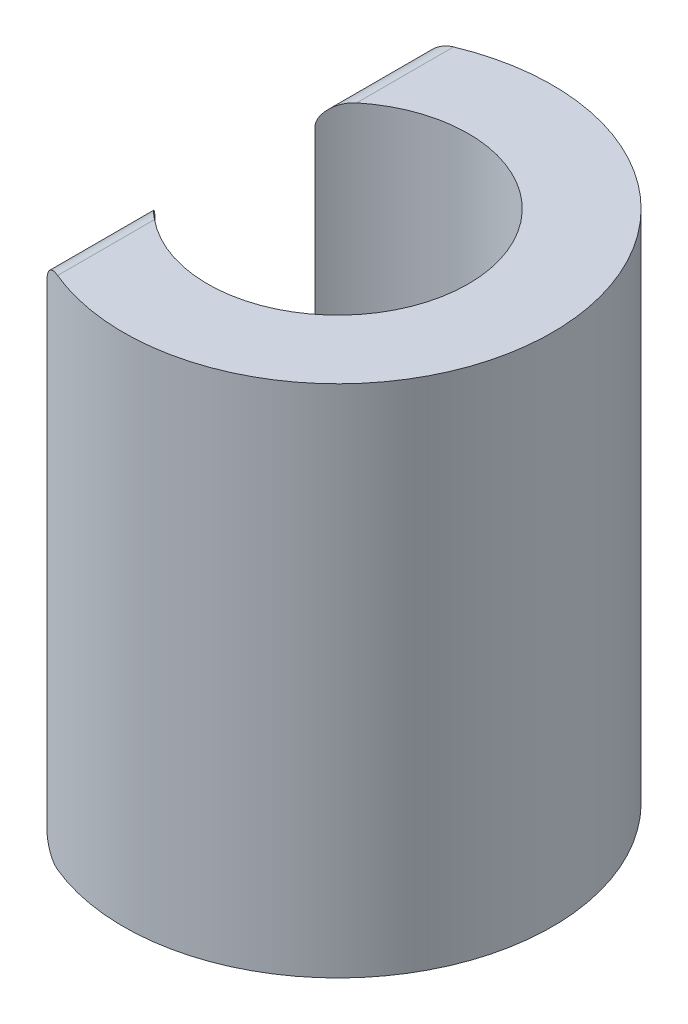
ISO-10303-21;
HEADER;
FILE_DESCRIPTION(('STEP AP214'),'2;1');
FILE_NAME('part.step','',(''),(''),'','','');
FILE_SCHEMA(('AUTOMOTIVE_DESIGN { 1 0 10303 214 1 1 1 1 }'));
ENDSEC;
DATA;
#1=APPLICATION_CONTEXT('core data for automotive mechanical design processes');
#2=APPLICATION_PROTOCOL_DEFINITION('international standard','automotive_design',2000,#1);
#3=PRODUCT_CONTEXT('',#1,'mechanical');
#4=PRODUCT('Part','Part','',(#3));
#5=PRODUCT_RELATED_PRODUCT_CATEGORY('part','',(#4));
#6=PRODUCT_DEFINITION_FORMATION('','',#4);
#7=PRODUCT_DEFINITION_CONTEXT('part definition',#1,'design');
#8=PRODUCT_DEFINITION('design','',#6,#7);
#9=PRODUCT_DEFINITION_SHAPE('','',#8);
#10=(LENGTH_UNIT() NAMED_UNIT(*) SI_UNIT(.MILLI.,.METRE.));
#11=(NAMED_UNIT(*) PLANE_ANGLE_UNIT() SI_UNIT($,.RADIAN.));
#12=(NAMED_UNIT(*) SI_UNIT($,.STERADIAN.) SOLID_ANGLE_UNIT());
#13=UNCERTAINTY_MEASURE_WITH_UNIT(LENGTH_MEASURE(1.E-05),#10,'distance_accuracy_value','');
#14=(GEOMETRIC_REPRESENTATION_CONTEXT(3) GLOBAL_UNCERTAINTY_ASSIGNED_CONTEXT((#13)) GLOBAL_UNIT_ASSIGNED_CONTEXT((#10,
#11,#12)) REPRESENTATION_CONTEXT('',''));
#15=CARTESIAN_POINT('',(0.,0.,0.));
#16=DIRECTION('',(0.,0.,1.));
#17=DIRECTION('',(1.,0.,0.));
#18=AXIS2_PLACEMENT_3D('',#15,#16,#17);
#19=CARTESIAN_POINT('',(0.,19.05,0.));
#20=DIRECTION('',(0.,-1.,0.));
#21=DIRECTION('',(0.,0.,-1.));
#22=AXIS2_PLACEMENT_3D('',#19,#20,#21);
#23=CYLINDRICAL_SURFACE('',#22,7.93750000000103);
#24=DIRECTION('',(0.,-1.,0.));
#25=VECTOR('',#24,1.);
#26=CARTESIAN_POINT('',(-3.81000000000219,19.05,-6.96331862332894));
#27=LINE('',#26,#25);
#28=CARTESIAN_POINT('',(-3.81000000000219,18.288,-6.96331862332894));
#29=VERTEX_POINT('',#28);
#30=CARTESIAN_POINT('',(-3.81000000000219,0.762000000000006,-6.96331862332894));
#31=VERTEX_POINT('',#30);
#32=EDGE_CURVE('E120',#29,#31,#27,.T.);
#33=ORIENTED_EDGE('',*,*,#32,.F.);
#34=CARTESIAN_POINT('',(-3.81000000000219,18.288,-6.96331862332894));
#35=CARTESIAN_POINT('',(-3.81000112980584,18.3076710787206,-6.96331747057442));
#36=CARTESIAN_POINT('',(-3.8092377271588,18.327331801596,-6.96373575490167));
#37=CARTESIAN_POINT('',(-3.80620065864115,18.3664943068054,-6.96539642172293));
#38=CARTESIAN_POINT('',(-3.8039275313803,18.3859961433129,-6.96663851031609));
#39=CARTESIAN_POINT('',(-3.79490229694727,18.443875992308,-6.97156167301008));
#40=CARTESIAN_POINT('',(-3.78594388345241,18.48183544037,-6.97643997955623));
#41=CARTESIAN_POINT('',(-3.76256924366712,18.5554471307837,-6.98907378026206));
#42=CARTESIAN_POINT('',(-3.74815831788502,18.5911015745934,-6.9968264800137));
#43=CARTESIAN_POINT('',(-3.71445934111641,18.6593850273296,-7.01477452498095));
#44=CARTESIAN_POINT('',(-3.69516692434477,18.692011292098,-7.0249720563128));
#45=CARTESIAN_POINT('',(-3.65119240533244,18.7552991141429,-7.04793209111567));
#46=CARTESIAN_POINT('',(-3.62627288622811,18.7857550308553,-7.06080453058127));
#47=CARTESIAN_POINT('',(-3.57250514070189,18.8421273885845,-7.08816079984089));
#48=CARTESIAN_POINT('',(-3.54365555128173,18.8680422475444,-7.10264518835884));
#49=CARTESIAN_POINT('',(-3.47924778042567,18.9176872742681,-7.13443555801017));
#50=CARTESIAN_POINT('',(-3.44329968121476,18.9408267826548,-7.1518746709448));
#51=CARTESIAN_POINT('',(-3.3683379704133,18.9806986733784,-7.18748436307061));
#52=CARTESIAN_POINT('',(-3.32932322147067,18.9974286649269,-7.20565521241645));
#53=CARTESIAN_POINT('',(-3.25046580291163,19.0237447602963,-7.24155920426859));
#54=CARTESIAN_POINT('',(-3.21069330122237,19.0335490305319,-7.25928692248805));
#55=CARTESIAN_POINT('',(-3.13000227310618,19.0466783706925,-7.29444815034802));
#56=CARTESIAN_POINT('',(-3.08908456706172,19.0500079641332,-7.31188185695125));
#57=CARTESIAN_POINT('',(-3.04800000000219,19.05,-7.32895642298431));
#58=B_SPLINE_CURVE_WITH_KNOTS('',3,(#34,#35,#36,#37,#38,#39,#40,#41,#42,#43,#44,#45,#46,#47,#48,
#49,#50,#51,#52,#53,#54,#55,#56,#57),.UNSPECIFIED.,.F.,.F.,(4,2,2,2,2,2,2,2,2,2,2,4),(0.,
0.0589738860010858,0.117926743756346,0.235219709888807,0.352398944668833,0.469683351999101,
0.593394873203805,0.717149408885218,0.855085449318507,0.993072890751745,1.1264921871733,
1.25981823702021),.UNSPECIFIED.);
#59=CARTESIAN_POINT('',(-3.04800000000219,19.05,-7.32895642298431));
#60=VERTEX_POINT('',#59);
#61=EDGE_CURVE('E107',#29,#60,#58,.T.);
#62=ORIENTED_EDGE('',*,*,#61,.T.);
#63=CARTESIAN_POINT('',(0.,19.05,0.));
#64=DIRECTION('',(0.,1.,0.));
#65=DIRECTION('',(0.,0.,1.));
#66=AXIS2_PLACEMENT_3D('',#63,#64,#65);
#67=CIRCLE('',#66,7.93750000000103);
#68=CARTESIAN_POINT('',(-3.04800000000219,19.05,7.32895642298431));
#69=VERTEX_POINT('',#68);
#70=EDGE_CURVE('E115',#69,#60,#67,.T.);
#71=ORIENTED_EDGE('',*,*,#70,.F.);
#72=CARTESIAN_POINT('',(-3.04800000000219,19.05,7.32895642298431));
#73=CARTESIAN_POINT('',(-3.09471095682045,19.0500130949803,7.30954976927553));
#74=CARTESIAN_POINT('',(-3.14120250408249,19.0457067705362,7.28967184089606));
#75=CARTESIAN_POINT('',(-3.23255304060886,19.0287684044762,7.2496151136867));
#76=CARTESIAN_POINT('',(-3.27741083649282,19.0161304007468,7.22943610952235));
#77=CARTESIAN_POINT('',(-3.36424114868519,18.9828382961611,7.18944331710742));
#78=CARTESIAN_POINT('',(-3.4062129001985,18.96218208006,7.16962962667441));
#79=CARTESIAN_POINT('',(-3.48605356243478,18.9132546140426,7.13114965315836));
#80=CARTESIAN_POINT('',(-3.52392335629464,18.8849850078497,7.11248312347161));
#81=CARTESIAN_POINT('',(-3.59357767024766,18.8219935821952,7.07754170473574));
#82=CARTESIAN_POINT('',(-3.62547039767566,18.7874148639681,7.06122585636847));
#83=CARTESIAN_POINT('',(-3.68280061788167,18.7121515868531,7.03149566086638));
#84=CARTESIAN_POINT('',(-3.70824083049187,18.6714696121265,7.01808009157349));
#85=CARTESIAN_POINT('',(-3.74921448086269,18.5893932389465,6.99626935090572));
#86=CARTESIAN_POINT('',(-3.76547349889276,18.5484576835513,6.9875114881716));
#87=CARTESIAN_POINT('',(-3.79073759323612,18.4638445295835,6.97383869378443));
#88=CARTESIAN_POINT('',(-3.7997615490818,18.4201743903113,6.96891376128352));
#89=CARTESIAN_POINT('',(-3.8066005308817,18.3613988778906,6.96517769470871));
#90=CARTESIAN_POINT('',(-3.80787501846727,18.3467473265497,6.96448093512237));
#91=CARTESIAN_POINT('',(-3.80957365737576,18.3173998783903,6.96355197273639));
#92=CARTESIAN_POINT('',(-3.80999893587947,18.3027040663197,6.96331915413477));
#93=CARTESIAN_POINT('',(-3.8100000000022,18.288,6.96331862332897));
#94=B_SPLINE_CURVE_WITH_KNOTS('',3,(#72,#73,#74,#75,#76,#77,#78,#79,#80,#81,#82,#83,#84,#85,#86,
#87,#88,#89,#90,#91,#92,#93),.UNSPECIFIED.,.F.,.F.,(4,2,2,2,2,2,2,2,2,2,4),(0.,0.15153372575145,
0.303176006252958,0.454858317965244,0.606507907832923,0.755069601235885,0.903568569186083,
1.03754345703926,1.17116759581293,1.21531404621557,1.25940186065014),.UNSPECIFIED.);
#95=CARTESIAN_POINT('',(-3.81000000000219,18.288,6.96331862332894));
#96=VERTEX_POINT('',#95);
#97=EDGE_CURVE('E59',#69,#96,#94,.T.);
#98=ORIENTED_EDGE('',*,*,#97,.T.);
#99=DIRECTION('',(0.,-1.,0.));
#100=VECTOR('',#99,1.);
#101=CARTESIAN_POINT('',(-3.81000000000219,19.05,6.96331862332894));
#102=LINE('',#101,#100);
#103=CARTESIAN_POINT('',(-3.81000000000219,0.762000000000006,6.96331862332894));
#104=VERTEX_POINT('',#103);
#105=EDGE_CURVE('E126',#96,#104,#102,.T.);
#106=ORIENTED_EDGE('',*,*,#105,.T.);
#107=CARTESIAN_POINT('',(-3.81000000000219,0.761999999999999,6.96331862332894));
#108=CARTESIAN_POINT('',(-3.81000112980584,0.742328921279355,6.96331747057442));
#109=CARTESIAN_POINT('',(-3.8092377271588,0.722668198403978,6.96373575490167));
#110=CARTESIAN_POINT('',(-3.80620065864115,0.683505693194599,6.96539642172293));
#111=CARTESIAN_POINT('',(-3.8039275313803,0.664003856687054,6.96663851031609));
#112=CARTESIAN_POINT('',(-3.79490229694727,0.606124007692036,6.97156167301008));
#113=CARTESIAN_POINT('',(-3.78594388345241,0.568164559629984,6.97643997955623));
#114=CARTESIAN_POINT('',(-3.76256924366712,0.494552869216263,6.98907378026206));
#115=CARTESIAN_POINT('',(-3.74815831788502,0.4588984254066,6.99682648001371));
#116=CARTESIAN_POINT('',(-3.7144593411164,0.390614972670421,7.01477452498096));
#117=CARTESIAN_POINT('',(-3.69516692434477,0.357988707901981,7.0249720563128));
#118=CARTESIAN_POINT('',(-3.65119240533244,0.294700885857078,7.04793209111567));
#119=CARTESIAN_POINT('',(-3.62627288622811,0.264244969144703,7.06080453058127));
#120=CARTESIAN_POINT('',(-3.57250514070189,0.207872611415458,7.08816079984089));
#121=CARTESIAN_POINT('',(-3.54365555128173,0.181957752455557,7.10264518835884));
#122=CARTESIAN_POINT('',(-3.47924778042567,0.132312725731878,7.13443555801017));
#123=CARTESIAN_POINT('',(-3.44329968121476,0.109173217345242,7.1518746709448));
#124=CARTESIAN_POINT('',(-3.3683379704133,0.0693013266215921,7.18748436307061));
#125=CARTESIAN_POINT('',(-3.32932322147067,0.0525713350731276,7.20565521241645));
#126=CARTESIAN_POINT('',(-3.25046580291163,0.0262552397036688,7.24155920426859));
#127=CARTESIAN_POINT('',(-3.21069330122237,0.0164509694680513,7.25928692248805));
#128=CARTESIAN_POINT('',(-3.13000227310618,0.00332162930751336,7.29444815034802));
#129=CARTESIAN_POINT('',(-3.08908456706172,-7.9641331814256E-06,7.31188185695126));
#130=CARTESIAN_POINT('',(-3.04800000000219,0.,7.32895642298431));
#131=B_SPLINE_CURVE_WITH_KNOTS('',3,(#107,#108,#109,#110,#111,#112,#113,#114,#115,#116,#117,
#118,#119,#120,#121,#122,#123,#124,#125,#126,#127,#128,#129,#130),.UNSPECIFIED.,.F.,.F.,(4,2,2,
2,2,2,2,2,2,2,2,4),(0.,0.0589738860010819,0.117926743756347,0.235219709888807,0.352398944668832,
0.469683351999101,0.593394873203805,0.717149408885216,0.855085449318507,0.993072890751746,
1.1264921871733,1.25981823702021),.UNSPECIFIED.);
#132=CARTESIAN_POINT('',(-3.04800000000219,0.,7.32895642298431));
#133=VERTEX_POINT('',#132);
#134=EDGE_CURVE('E51',#104,#133,#131,.T.);
#135=ORIENTED_EDGE('',*,*,#134,.T.);
#136=CARTESIAN_POINT('',(0.,0.,0.));
#137=DIRECTION('',(0.,1.,0.));
#138=DIRECTION('',(0.,0.,1.));
#139=AXIS2_PLACEMENT_3D('',#136,#137,#138);
#140=CIRCLE('',#139,7.93750000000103);
#141=CARTESIAN_POINT('',(-3.04800000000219,0.,-7.32895642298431));
#142=VERTEX_POINT('',#141);
#143=EDGE_CURVE('E129',#133,#142,#140,.T.);
#144=ORIENTED_EDGE('',*,*,#143,.T.);
#145=CARTESIAN_POINT('',(-3.04800000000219,0.,-7.32895642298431));
#146=CARTESIAN_POINT('',(-3.09471095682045,-1.30949802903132E-05,-7.30954976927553));
#147=CARTESIAN_POINT('',(-3.14120250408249,0.00429322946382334,-7.28967184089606));
#148=CARTESIAN_POINT('',(-3.23255304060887,0.0212315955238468,-7.2496151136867));
#149=CARTESIAN_POINT('',(-3.27741083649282,0.0338695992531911,-7.22943610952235));
#150=CARTESIAN_POINT('',(-3.36424114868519,0.067161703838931,-7.18944331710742));
#151=CARTESIAN_POINT('',(-3.4062129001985,0.0878179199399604,-7.16962962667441));
#152=CARTESIAN_POINT('',(-3.48605356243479,0.136745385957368,-7.13114965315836));
#153=CARTESIAN_POINT('',(-3.52392335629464,0.16501499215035,-7.11248312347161));
#154=CARTESIAN_POINT('',(-3.59357767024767,0.22800641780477,-7.07754170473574));
#155=CARTESIAN_POINT('',(-3.62547039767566,0.262585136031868,-7.06122585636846));
#156=CARTESIAN_POINT('',(-3.68280061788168,0.337848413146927,-7.03149566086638));
#157=CARTESIAN_POINT('',(-3.70824083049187,0.378530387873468,-7.01808009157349));
#158=CARTESIAN_POINT('',(-3.74921448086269,0.460606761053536,-6.99626935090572));
#159=CARTESIAN_POINT('',(-3.76547349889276,0.501542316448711,-6.9875114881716));
#160=CARTESIAN_POINT('',(-3.79073759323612,0.586155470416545,-6.97383869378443));
#161=CARTESIAN_POINT('',(-3.7997615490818,0.629825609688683,-6.96891376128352));
#162=CARTESIAN_POINT('',(-3.8066005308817,0.688601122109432,-6.96517769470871));
#163=CARTESIAN_POINT('',(-3.80787501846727,0.703252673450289,-6.96448093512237));
#164=CARTESIAN_POINT('',(-3.80957365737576,0.732600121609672,-6.96355197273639));
#165=CARTESIAN_POINT('',(-3.80999893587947,0.747295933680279,-6.96331915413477));
#166=CARTESIAN_POINT('',(-3.8100000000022,0.762,-6.96331862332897));
#167=B_SPLINE_CURVE_WITH_KNOTS('',3,(#145,#146,#147,#148,#149,#150,#151,#152,#153,#154,#155,
#156,#157,#158,#159,#160,#161,#162,#163,#164,#165,#166),.UNSPECIFIED.,.F.,.F.,(4,2,2,2,2,2,2,2,
2,2,4),(0.,0.151533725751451,0.303176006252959,0.454858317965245,0.606507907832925,
0.755069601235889,0.903568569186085,1.03754345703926,1.17116759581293,1.21531404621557,
1.25940186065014),.UNSPECIFIED.);
#168=EDGE_CURVE('E108',#142,#31,#167,.T.);
#169=ORIENTED_EDGE('',*,*,#168,.T.);
#170=EDGE_LOOP('',(#33,#62,#71,#98,#106,#135,#144,#169));
#171=FACE_BOUND('',#170,.T.);
#172=ADVANCED_FACE('F35',(#171),#23,.T.);
#173=CARTESIAN_POINT('',(-3.81000000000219,19.05,-6.96331862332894));
#174=DIRECTION('',(1.,0.,0.));
#175=DIRECTION('',(0.,0.,-1.));
#176=AXIS2_PLACEMENT_3D('',#173,#174,#175);
#177=PLANE('',#176);
#178=DIRECTION('',(0.,-1.,0.));
#179=VECTOR('',#178,1.);
#180=CARTESIAN_POINT('',(-3.81000000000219,19.05,-2.96212356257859));
#181=LINE('',#180,#179);
#182=CARTESIAN_POINT('',(-3.81000000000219,18.288,-2.96212356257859));
#183=VERTEX_POINT('',#182);
#184=CARTESIAN_POINT('',(-3.81000000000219,0.762000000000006,-2.96212356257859));
#185=VERTEX_POINT('',#184);
#186=EDGE_CURVE('E138',#183,#185,#181,.T.);
#187=ORIENTED_EDGE('',*,*,#186,.F.);
#188=DIRECTION('',(0.,0.,1.));
#189=VECTOR('',#188,1.);
#190=CARTESIAN_POINT('',(-3.81000000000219,18.288,-6.96331862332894));
#191=LINE('',#190,#189);
#192=EDGE_CURVE('E209',#183,#29,#191,.F.);
#193=ORIENTED_EDGE('',*,*,#192,.T.);
#194=ORIENTED_EDGE('',*,*,#32,.T.);
#195=DIRECTION('',(0.,0.,1.));
#196=VECTOR('',#195,1.);
#197=CARTESIAN_POINT('',(-3.81000000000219,0.761999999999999,-6.96331862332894));
#198=LINE('',#197,#196);
#199=EDGE_CURVE('E210',#31,#185,#198,.T.);
#200=ORIENTED_EDGE('',*,*,#199,.T.);
#201=EDGE_LOOP('',(#187,#193,#194,#200));
#202=FACE_BOUND('',#201,.T.);
#203=ADVANCED_FACE('F161',(#202),#177,.F.);
#204=CARTESIAN_POINT('',(0.,19.05,0.));
#205=DIRECTION('',(0.,-1.,0.));
#206=DIRECTION('',(0.,0.,-1.));
#207=AXIS2_PLACEMENT_3D('',#204,#205,#206);
#208=CYLINDRICAL_SURFACE('',#207,4.826);
#209=CARTESIAN_POINT('',(0.,19.05,0.));
#210=DIRECTION('',(0.,-1.,0.));
#211=DIRECTION('',(0.,0.,1.));
#212=AXIS2_PLACEMENT_3D('',#209,#210,#211);
#213=CIRCLE('',#212,4.826);
#214=CARTESIAN_POINT('',(-3.04800000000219,19.05,-3.7416536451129));
#215=VERTEX_POINT('',#214);
#216=CARTESIAN_POINT('',(-3.04800000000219,19.05,3.7416536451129));
#217=VERTEX_POINT('',#216);
#218=EDGE_CURVE('E118',#215,#217,#213,.T.);
#219=ORIENTED_EDGE('',*,*,#218,.F.);
#220=CARTESIAN_POINT('',(-3.04800000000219,19.05,-3.7416536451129));
#221=CARTESIAN_POINT('',(-3.07294029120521,19.0499962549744,-3.72133874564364));
#222=CARTESIAN_POINT('',(-3.09766180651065,19.0487758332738,-3.70078336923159));
#223=CARTESIAN_POINT('',(-3.14655009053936,19.0440001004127,-3.65930642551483));
#224=CARTESIAN_POINT('',(-3.17071708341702,19.0404457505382,-3.63838501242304));
#225=CARTESIAN_POINT('',(-3.24245342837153,19.0263862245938,-3.57503086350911));
#226=CARTESIAN_POINT('',(-3.28903431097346,19.0124862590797,-3.53219085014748));
#227=CARTESIAN_POINT('',(-3.38503191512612,18.9736426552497,-3.44047157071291));
#228=CARTESIAN_POINT('',(-3.43392643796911,18.9474209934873,-3.39159011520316));
#229=CARTESIAN_POINT('',(-3.52607090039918,18.8840010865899,-3.29567697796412));
#230=CARTESIAN_POINT('',(-3.56933192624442,18.8468248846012,-3.24864179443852));
#231=CARTESIAN_POINT('',(-3.63248790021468,18.7781290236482,-3.17751221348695));
#232=CARTESIAN_POINT('',(-3.65475421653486,18.7504079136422,-3.15183655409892));
#233=CARTESIAN_POINT('',(-3.69607558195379,18.6904494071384,-3.10327378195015));
#234=CARTESIAN_POINT('',(-3.71513468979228,18.6582178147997,-3.0803831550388));
#235=CARTESIAN_POINT('',(-3.74498164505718,18.5973773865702,-3.04397860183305));
#236=CARTESIAN_POINT('',(-3.75665590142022,18.5697674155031,-3.02953438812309));
#237=CARTESIAN_POINT('',(-3.7769715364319,18.5120026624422,-3.00416776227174));
#238=CARTESIAN_POINT('',(-3.78562391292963,18.4818576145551,-2.99323259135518));
#239=CARTESIAN_POINT('',(-3.7981039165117,18.424706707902,-2.97737684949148));
#240=CARTESIAN_POINT('',(-3.80249770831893,18.3980235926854,-2.97175469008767));
#241=CARTESIAN_POINT('',(-3.80847678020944,18.3435923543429,-2.96408316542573));
#242=CARTESIAN_POINT('',(-3.810035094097,18.3158365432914,-2.96206810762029));
#243=CARTESIAN_POINT('',(-3.81000000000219,18.288,-2.96212356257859));
#244=B_SPLINE_CURVE_WITH_KNOTS('',3,(#220,#221,#222,#223,#224,#225,#226,#227,#228,#229,#230,
#231,#232,#233,#234,#235,#236,#237,#238,#239,#240,#241,#242,#243),.UNSPECIFIED.,.F.,.F.,(4,2,2,
2,2,2,2,2,2,2,2,4),(0.,0.096445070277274,0.192850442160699,0.386519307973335,0.607419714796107,
0.827878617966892,0.959127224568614,1.09020846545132,1.18970016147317,1.28882589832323,
1.3713082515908,1.4545710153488),.UNSPECIFIED.);
#245=EDGE_CURVE('E174',#215,#183,#244,.T.);
#246=ORIENTED_EDGE('',*,*,#245,.T.);
#247=ORIENTED_EDGE('',*,*,#186,.T.);
#248=CARTESIAN_POINT('',(-3.81000000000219,0.761999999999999,-2.96212356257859));
#249=CARTESIAN_POINT('',(-3.81000328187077,0.745759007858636,-2.96211810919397));
#250=CARTESIAN_POINT('',(-3.80948033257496,0.729530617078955,-2.96279205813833));
#251=CARTESIAN_POINT('',(-3.80741682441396,0.697269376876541,-2.96544391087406));
#252=CARTESIAN_POINT('',(-3.80587776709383,0.681236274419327,-2.96741989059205));
#253=CARTESIAN_POINT('',(-3.79984138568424,0.634044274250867,-2.97515122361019));
#254=CARTESIAN_POINT('',(-3.79392273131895,0.603343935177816,-2.98271320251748));
#255=CARTESIAN_POINT('',(-3.77887295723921,0.544291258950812,-3.00175582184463));
#256=CARTESIAN_POINT('',(-3.76975950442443,0.515927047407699,-3.01321490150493));
#257=CARTESIAN_POINT('',(-3.74888180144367,0.461567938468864,-3.03915132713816));
#258=CARTESIAN_POINT('',(-3.73710805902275,0.435582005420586,-3.05363946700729));
#259=CARTESIAN_POINT('',(-3.70372348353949,0.371280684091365,-3.09414617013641));
#260=CARTESIAN_POINT('',(-3.68044633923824,0.334911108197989,-3.12187081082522));
#261=CARTESIAN_POINT('',(-3.62982217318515,0.268150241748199,-3.18059524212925));
#262=CARTESIAN_POINT('',(-3.6024650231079,0.237774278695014,-3.2116031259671));
#263=CARTESIAN_POINT('',(-3.53264880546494,0.171287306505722,-3.28851645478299));
#264=CARTESIAN_POINT('',(-3.48858729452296,0.137906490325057,-3.33533098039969));
#265=CARTESIAN_POINT('',(-3.39543635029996,0.0816416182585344,-3.43011966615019));
#266=CARTESIAN_POINT('',(-3.34634785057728,0.0587556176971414,-3.47809360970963));
#267=CARTESIAN_POINT('',(-3.2560176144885,0.0277715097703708,-3.56251314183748));
#268=CARTESIAN_POINT('',(-3.2156045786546,0.0174724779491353,-3.59904611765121));
#269=CARTESIAN_POINT('',(-3.13301494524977,0.00361054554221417,-3.67117629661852));
#270=CARTESIAN_POINT('',(-3.09084273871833,3.17915344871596E-05,-3.70677550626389));
#271=CARTESIAN_POINT('',(-3.04800000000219,0.,-3.7416536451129));
#272=B_SPLINE_CURVE_WITH_KNOTS('',3,(#248,#249,#250,#251,#252,#253,#254,#255,#256,#257,#258,
#259,#260,#261,#262,#263,#264,#265,#266,#267,#268,#269,#270,#271),.UNSPECIFIED.,.F.,.F.,(4,2,2,
2,2,2,2,2,2,2,2,4),(0.,0.0486775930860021,0.0972834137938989,0.193173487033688,
0.288541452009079,0.384255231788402,0.537339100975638,0.690809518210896,0.907005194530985,
1.12316079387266,1.28906695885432,1.4545812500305),.UNSPECIFIED.);
#273=CARTESIAN_POINT('',(-3.04800000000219,0.,-3.7416536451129));
#274=VERTEX_POINT('',#273);
#275=EDGE_CURVE('E150',#185,#274,#272,.T.);
#276=ORIENTED_EDGE('',*,*,#275,.T.);
#277=CARTESIAN_POINT('',(0.,0.,0.));
#278=DIRECTION('',(0.,-1.,0.));
#279=DIRECTION('',(0.,0.,1.));
#280=AXIS2_PLACEMENT_3D('',#277,#278,#279);
#281=CIRCLE('',#280,4.826);
#282=CARTESIAN_POINT('',(-3.04800000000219,0.,3.7416536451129));
#283=VERTEX_POINT('',#282);
#284=EDGE_CURVE('E124',#274,#283,#281,.T.);
#285=ORIENTED_EDGE('',*,*,#284,.T.);
#286=CARTESIAN_POINT('',(-3.04800000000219,0.,3.7416536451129));
#287=CARTESIAN_POINT('',(-3.07294029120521,3.74502556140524E-06,3.72133874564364));
#288=CARTESIAN_POINT('',(-3.09766180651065,0.00122416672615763,3.70078336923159));
#289=CARTESIAN_POINT('',(-3.14655009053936,0.00599989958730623,3.65930642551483));
#290=CARTESIAN_POINT('',(-3.17071708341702,0.00955424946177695,3.63838501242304));
#291=CARTESIAN_POINT('',(-3.24245342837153,0.023613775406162,3.57503086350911));
#292=CARTESIAN_POINT('',(-3.28903431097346,0.0375137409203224,3.53219085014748));
#293=CARTESIAN_POINT('',(-3.38503191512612,0.0763573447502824,3.44047157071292));
#294=CARTESIAN_POINT('',(-3.43392643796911,0.102579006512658,3.39159011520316));
#295=CARTESIAN_POINT('',(-3.52607090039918,0.165998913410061,3.29567697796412));
#296=CARTESIAN_POINT('',(-3.56933192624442,0.203175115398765,3.24864179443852));
#297=CARTESIAN_POINT('',(-3.63248790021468,0.271870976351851,3.17751221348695));
#298=CARTESIAN_POINT('',(-3.65475421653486,0.299592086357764,3.15183655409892));
#299=CARTESIAN_POINT('',(-3.69607558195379,0.359550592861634,3.10327378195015));
#300=CARTESIAN_POINT('',(-3.71513468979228,0.391782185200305,3.0803831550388));
#301=CARTESIAN_POINT('',(-3.74498164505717,0.452622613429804,3.04397860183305));
#302=CARTESIAN_POINT('',(-3.75665590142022,0.480232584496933,3.02953438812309));
#303=CARTESIAN_POINT('',(-3.7769715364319,0.537997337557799,3.00416776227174));
#304=CARTESIAN_POINT('',(-3.78562391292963,0.56814238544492,2.99323259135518));
#305=CARTESIAN_POINT('',(-3.7981039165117,0.625293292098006,2.97737684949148));
#306=CARTESIAN_POINT('',(-3.80249770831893,0.651976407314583,2.97175469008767));
#307=CARTESIAN_POINT('',(-3.80847678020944,0.706407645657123,2.96408316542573));
#308=CARTESIAN_POINT('',(-3.810035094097,0.734163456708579,2.96206810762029));
#309=CARTESIAN_POINT('',(-3.81000000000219,0.761999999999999,2.96212356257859));
#310=B_SPLINE_CURVE_WITH_KNOTS('',3,(#286,#287,#288,#289,#290,#291,#292,#293,#294,#295,#296,
#297,#298,#299,#300,#301,#302,#303,#304,#305,#306,#307,#308,#309),.UNSPECIFIED.,.F.,.F.,(4,2,2,
2,2,2,2,2,2,2,2,4),(0.,0.0964450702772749,0.1928504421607,0.386519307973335,0.607419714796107,
0.827878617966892,0.959127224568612,1.09020846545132,1.18970016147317,1.28882589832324,
1.3713082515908,1.4545710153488),.UNSPECIFIED.);
#311=CARTESIAN_POINT('',(-3.81000000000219,0.762000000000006,2.96212356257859));
#312=VERTEX_POINT('',#311);
#313=EDGE_CURVE('E144',#283,#312,#310,.T.);
#314=ORIENTED_EDGE('',*,*,#313,.T.);
#315=DIRECTION('',(0.,-1.,0.));
#316=VECTOR('',#315,1.);
#317=CARTESIAN_POINT('',(-3.81000000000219,19.05,2.96212356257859));
#318=LINE('',#317,#316);
#319=CARTESIAN_POINT('',(-3.81000000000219,18.288,2.96212356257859));
#320=VERTEX_POINT('',#319);
#321=EDGE_CURVE('E135',#320,#312,#318,.T.);
#322=ORIENTED_EDGE('',*,*,#321,.F.);
#323=CARTESIAN_POINT('',(-3.81000000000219,18.288,2.96212356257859));
#324=CARTESIAN_POINT('',(-3.81000328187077,18.3042409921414,2.96211810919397));
#325=CARTESIAN_POINT('',(-3.80948033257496,18.320469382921,2.96279205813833));
#326=CARTESIAN_POINT('',(-3.80741682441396,18.3527306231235,2.96544391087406));
#327=CARTESIAN_POINT('',(-3.80587776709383,18.3687637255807,2.96741989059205));
#328=CARTESIAN_POINT('',(-3.79984138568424,18.4159557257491,2.97515122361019));
#329=CARTESIAN_POINT('',(-3.79392273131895,18.4466560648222,2.98271320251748));
#330=CARTESIAN_POINT('',(-3.77887295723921,18.5057087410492,3.00175582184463));
#331=CARTESIAN_POINT('',(-3.76975950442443,18.5340729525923,3.01321490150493));
#332=CARTESIAN_POINT('',(-3.74888180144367,18.5884320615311,3.03915132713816));
#333=CARTESIAN_POINT('',(-3.73710805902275,18.6144179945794,3.05363946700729));
#334=CARTESIAN_POINT('',(-3.70372348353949,18.6787193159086,3.09414617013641));
#335=CARTESIAN_POINT('',(-3.68044633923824,18.715088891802,3.12187081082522));
#336=CARTESIAN_POINT('',(-3.62982217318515,18.7818497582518,3.18059524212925));
#337=CARTESIAN_POINT('',(-3.6024650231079,18.812225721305,3.2116031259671));
#338=CARTESIAN_POINT('',(-3.53264880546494,18.8787126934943,3.28851645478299));
#339=CARTESIAN_POINT('',(-3.48858729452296,18.9120935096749,3.33533098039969));
#340=CARTESIAN_POINT('',(-3.39543635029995,18.9683583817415,3.43011966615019));
#341=CARTESIAN_POINT('',(-3.34634785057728,18.9912443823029,3.47809360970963));
#342=CARTESIAN_POINT('',(-3.2560176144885,19.0222284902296,3.56251314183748));
#343=CARTESIAN_POINT('',(-3.2156045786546,19.0325275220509,3.59904611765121));
#344=CARTESIAN_POINT('',(-3.13301494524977,19.0463894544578,3.67117629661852));
#345=CARTESIAN_POINT('',(-3.09084273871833,19.0499682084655,3.70677550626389));
#346=CARTESIAN_POINT('',(-3.04800000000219,19.05,3.7416536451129));
#347=B_SPLINE_CURVE_WITH_KNOTS('',3,(#323,#324,#325,#326,#327,#328,#329,#330,#331,#332,#333,
#334,#335,#336,#337,#338,#339,#340,#341,#342,#343,#344,#345,#346),.UNSPECIFIED.,.F.,.F.,(4,2,2,
2,2,2,2,2,2,2,2,4),(0.,0.0486775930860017,0.0972834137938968,0.19317348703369,0.288541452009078,
0.384255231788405,0.53733910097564,0.690809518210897,0.907005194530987,1.12316079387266,
1.28906695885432,1.4545812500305),.UNSPECIFIED.);
#348=EDGE_CURVE('E169',#320,#217,#347,.T.);
#349=ORIENTED_EDGE('',*,*,#348,.T.);
#350=EDGE_LOOP('',(#219,#246,#247,#276,#285,#314,#322,#349));
#351=FACE_BOUND('',#350,.T.);
#352=ADVANCED_FACE('F155',(#351),#208,.F.);
#353=CARTESIAN_POINT('',(-3.81000000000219,19.05,2.96212356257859));
#354=DIRECTION('',(1.,0.,0.));
#355=DIRECTION('',(0.,0.,-1.));
#356=AXIS2_PLACEMENT_3D('',#353,#354,#355);
#357=PLANE('',#356);
#358=ORIENTED_EDGE('',*,*,#105,.F.);
#359=DIRECTION('',(0.,0.,1.));
#360=VECTOR('',#359,1.);
#361=CARTESIAN_POINT('',(-3.81000000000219,18.288,2.96212356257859));
#362=LINE('',#361,#360);
#363=EDGE_CURVE('E106',#96,#320,#362,.F.);
#364=ORIENTED_EDGE('',*,*,#363,.T.);
#365=ORIENTED_EDGE('',*,*,#321,.T.);
#366=DIRECTION('',(0.,0.,1.));
#367=VECTOR('',#366,1.);
#368=CARTESIAN_POINT('',(-3.81000000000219,0.761999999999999,2.96212356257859));
#369=LINE('',#368,#367);
#370=EDGE_CURVE('E217',#312,#104,#369,.T.);
#371=ORIENTED_EDGE('',*,*,#370,.T.);
#372=EDGE_LOOP('',(#358,#364,#365,#371));
#373=FACE_BOUND('',#372,.T.);
#374=ADVANCED_FACE('F160',(#373),#357,.F.);
#375=CARTESIAN_POINT('',(0.,19.05,0.));
#376=DIRECTION('',(0.,1.,0.));
#377=DIRECTION('',(0.,0.,1.));
#378=AXIS2_PLACEMENT_3D('',#375,#376,#377);
#379=PLANE('',#378);
#380=ORIENTED_EDGE('',*,*,#70,.T.);
#381=DIRECTION('',(0.,0.,1.));
#382=VECTOR('',#381,1.);
#383=CARTESIAN_POINT('',(-3.04800000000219,19.05,-2.96212356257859));
#384=LINE('',#383,#382);
#385=EDGE_CURVE('E119',#60,#215,#384,.T.);
#386=ORIENTED_EDGE('',*,*,#385,.T.);
#387=ORIENTED_EDGE('',*,*,#218,.T.);
#388=DIRECTION('',(0.,0.,1.));
#389=VECTOR('',#388,1.);
#390=CARTESIAN_POINT('',(-3.04800000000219,19.05,6.96331862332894));
#391=LINE('',#390,#389);
#392=EDGE_CURVE('E105',#217,#69,#391,.T.);
#393=ORIENTED_EDGE('',*,*,#392,.T.);
#394=EDGE_LOOP('',(#380,#386,#387,#393));
#395=FACE_BOUND('',#394,.T.);
#396=ADVANCED_FACE('F113',(#395),#379,.T.);
#397=CARTESIAN_POINT('',(0.,0.,0.));
#398=DIRECTION('',(0.,1.,0.));
#399=DIRECTION('',(0.,0.,1.));
#400=AXIS2_PLACEMENT_3D('',#397,#398,#399);
#401=PLANE('',#400);
#402=ORIENTED_EDGE('',*,*,#284,.F.);
#403=DIRECTION('',(0.,0.,1.));
#404=VECTOR('',#403,1.);
#405=CARTESIAN_POINT('',(-3.04800000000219,0.,0.));
#406=LINE('',#405,#404);
#407=EDGE_CURVE('E11',#274,#142,#406,.F.);
#408=ORIENTED_EDGE('',*,*,#407,.T.);
#409=ORIENTED_EDGE('',*,*,#143,.F.);
#410=DIRECTION('',(0.,0.,1.));
#411=VECTOR('',#410,1.);
#412=CARTESIAN_POINT('',(-3.04800000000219,0.,0.));
#413=LINE('',#412,#411);
#414=EDGE_CURVE('E44',#133,#283,#413,.F.);
#415=ORIENTED_EDGE('',*,*,#414,.T.);
#416=EDGE_LOOP('',(#402,#408,#409,#415));
#417=FACE_BOUND('',#416,.T.);
#418=ADVANCED_FACE('F223',(#417),#401,.F.);
#419=CARTESIAN_POINT('',(-3.04800000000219,18.288,0.));
#420=DIRECTION('',(0.,0.,-1.));
#421=DIRECTION('',(-1.,0.,0.));
#422=AXIS2_PLACEMENT_3D('',#419,#420,#421);
#423=CYLINDRICAL_SURFACE('',#422,0.762);
#424=ORIENTED_EDGE('',*,*,#61,.F.);
#425=ORIENTED_EDGE('',*,*,#192,.F.);
#426=ORIENTED_EDGE('',*,*,#245,.F.);
#427=ORIENTED_EDGE('',*,*,#385,.F.);
#428=EDGE_LOOP('',(#424,#425,#426,#427));
#429=FACE_BOUND('',#428,.T.);
#430=ADVANCED_FACE('F183',(#429),#423,.T.);
#431=CARTESIAN_POINT('',(-3.04800000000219,18.288,0.));
#432=DIRECTION('',(0.,0.,-1.));
#433=DIRECTION('',(-1.,0.,0.));
#434=AXIS2_PLACEMENT_3D('',#431,#432,#433);
#435=CYLINDRICAL_SURFACE('',#434,0.762);
#436=ORIENTED_EDGE('',*,*,#348,.F.);
#437=ORIENTED_EDGE('',*,*,#363,.F.);
#438=ORIENTED_EDGE('',*,*,#97,.F.);
#439=ORIENTED_EDGE('',*,*,#392,.F.);
#440=EDGE_LOOP('',(#436,#437,#438,#439));
#441=FACE_BOUND('',#440,.T.);
#442=ADVANCED_FACE('F104',(#441),#435,.T.);
#443=CARTESIAN_POINT('',(-3.04800000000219,0.761999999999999,-6.96331862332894));
#444=DIRECTION('',(0.,0.,1.));
#445=DIRECTION('',(1.,0.,0.));
#446=AXIS2_PLACEMENT_3D('',#443,#444,#445);
#447=CYLINDRICAL_SURFACE('',#446,0.762);
#448=ORIENTED_EDGE('',*,*,#168,.F.);
#449=ORIENTED_EDGE('',*,*,#407,.F.);
#450=ORIENTED_EDGE('',*,*,#275,.F.);
#451=ORIENTED_EDGE('',*,*,#199,.F.);
#452=EDGE_LOOP('',(#448,#449,#450,#451));
#453=FACE_BOUND('',#452,.T.);
#454=ADVANCED_FACE('F182',(#453),#447,.T.);
#455=CARTESIAN_POINT('',(-3.04800000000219,0.761999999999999,2.96212356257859));
#456=DIRECTION('',(0.,0.,1.));
#457=DIRECTION('',(1.,0.,0.));
#458=AXIS2_PLACEMENT_3D('',#455,#456,#457);
#459=CYLINDRICAL_SURFACE('',#458,0.762);
#460=ORIENTED_EDGE('',*,*,#313,.F.);
#461=ORIENTED_EDGE('',*,*,#414,.F.);
#462=ORIENTED_EDGE('',*,*,#134,.F.);
#463=ORIENTED_EDGE('',*,*,#370,.F.);
#464=EDGE_LOOP('',(#460,#461,#462,#463));
#465=FACE_BOUND('',#464,.T.);
#466=ADVANCED_FACE('F37',(#465),#459,.T.);
#467=CLOSED_SHELL('',(#172,#203,#352,#374,#396,#418,#430,#442,#454,#466));
#468=MANIFOLD_SOLID_BREP('B2',#467);
#469=ADVANCED_BREP_SHAPE_REPRESENTATION('',(#18,#468),#14);
#470=SHAPE_DEFINITION_REPRESENTATION(#9,#469);
ENDSEC;
END-ISO-10303-21;
